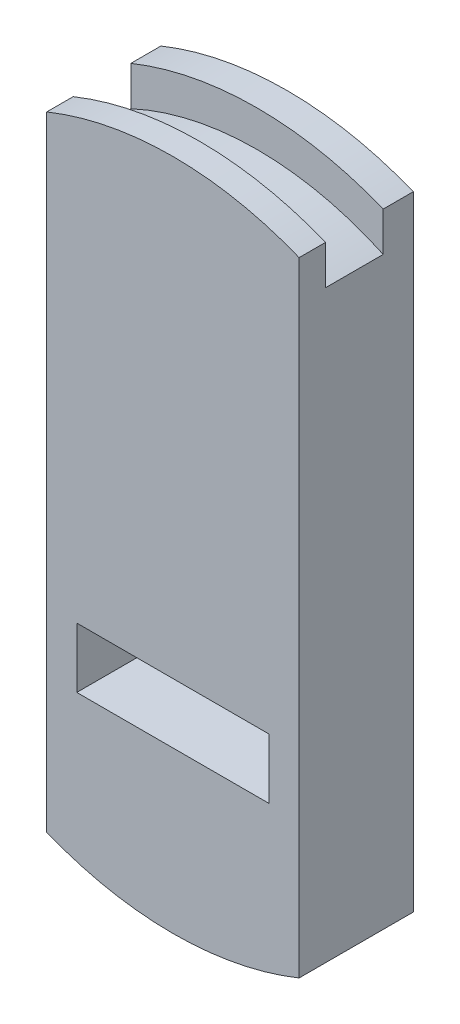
ISO-10303-21;
HEADER;
FILE_DESCRIPTION(('STEP AP214'),'2;1');
FILE_NAME('part.step','',(''),(''),'','','');
FILE_SCHEMA(('AUTOMOTIVE_DESIGN { 1 0 10303 214 1 1 1 1 }'));
ENDSEC;
DATA;
#1=APPLICATION_CONTEXT('core data for automotive mechanical design processes');
#2=APPLICATION_PROTOCOL_DEFINITION('international standard','automotive_design',2000,#1);
#3=PRODUCT_CONTEXT('',#1,'mechanical');
#4=PRODUCT('Part','Part','',(#3));
#5=PRODUCT_RELATED_PRODUCT_CATEGORY('part','',(#4));
#6=PRODUCT_DEFINITION_FORMATION('','',#4);
#7=PRODUCT_DEFINITION_CONTEXT('part definition',#1,'design');
#8=PRODUCT_DEFINITION('design','',#6,#7);
#9=PRODUCT_DEFINITION_SHAPE('','',#8);
#10=(LENGTH_UNIT() NAMED_UNIT(*) SI_UNIT(.MILLI.,.METRE.));
#11=(NAMED_UNIT(*) PLANE_ANGLE_UNIT() SI_UNIT($,.RADIAN.));
#12=(NAMED_UNIT(*) SI_UNIT($,.STERADIAN.) SOLID_ANGLE_UNIT());
#13=UNCERTAINTY_MEASURE_WITH_UNIT(LENGTH_MEASURE(1.E-05),#10,'distance_accuracy_value','');
#14=(GEOMETRIC_REPRESENTATION_CONTEXT(3) GLOBAL_UNCERTAINTY_ASSIGNED_CONTEXT((#13)) GLOBAL_UNIT_ASSIGNED_CONTEXT((#10,
#11,#12)) REPRESENTATION_CONTEXT('',''));
#15=CARTESIAN_POINT('',(0.,0.,0.));
#16=DIRECTION('',(0.,0.,1.));
#17=DIRECTION('',(1.,0.,0.));
#18=AXIS2_PLACEMENT_3D('',#15,#16,#17);
#19=CARTESIAN_POINT('',(0.,0.,7.3));
#20=DIRECTION('',(0.,0.,1.));
#21=DIRECTION('',(1.,0.,0.));
#22=AXIS2_PLACEMENT_3D('',#19,#20,#21);
#23=PLANE('',#22);
#24=CARTESIAN_POINT('',(0.,0.,7.3));
#25=DIRECTION('',(0.,0.,1.));
#26=DIRECTION('',(1.,0.,0.));
#27=AXIS2_PLACEMENT_3D('',#24,#25,#26);
#28=CIRCLE('',#27,28.);
#29=CARTESIAN_POINT('',(10.5,25.9566947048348,7.3));
#30=VERTEX_POINT('',#29);
#31=CARTESIAN_POINT('',(-10.5,25.9566947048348,7.3));
#32=VERTEX_POINT('',#31);
#33=EDGE_CURVE('E176',#30,#32,#28,.T.);
#34=ORIENTED_EDGE('',*,*,#33,.F.);
#35=DIRECTION('',(0.,-1.,0.));
#36=VECTOR('',#35,1.);
#37=CARTESIAN_POINT('',(10.5,0.,7.3));
#38=LINE('',#37,#36);
#39=CARTESIAN_POINT('',(10.5,22.6881026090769,7.3));
#40=VERTEX_POINT('',#39);
#41=EDGE_CURVE('E138',#30,#40,#38,.T.);
#42=ORIENTED_EDGE('',*,*,#41,.T.);
#43=CARTESIAN_POINT('',(0.,0.,7.3));
#44=DIRECTION('',(0.,0.,1.));
#45=DIRECTION('',(1.,0.,0.));
#46=AXIS2_PLACEMENT_3D('',#43,#44,#45);
#47=CIRCLE('',#46,25.);
#48=CARTESIAN_POINT('',(-10.5,22.6881026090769,7.3));
#49=VERTEX_POINT('',#48);
#50=EDGE_CURVE('E171',#40,#49,#47,.T.);
#51=ORIENTED_EDGE('',*,*,#50,.T.);
#52=DIRECTION('',(0.,1.,0.));
#53=VECTOR('',#52,1.);
#54=CARTESIAN_POINT('',(-10.5,0.,7.3));
#55=LINE('',#54,#53);
#56=EDGE_CURVE('E154',#49,#32,#55,.T.);
#57=ORIENTED_EDGE('',*,*,#56,.T.);
#58=EDGE_LOOP('',(#34,#42,#51,#57));
#59=FACE_BOUND('',#58,.T.);
#60=ADVANCED_FACE('F34',(#59),#23,.F.);
#61=CARTESIAN_POINT('',(0.,0.,2.5));
#62=DIRECTION('',(0.,0.,-1.));
#63=DIRECTION('',(-1.,0.,0.));
#64=AXIS2_PLACEMENT_3D('',#61,#62,#63);
#65=CYLINDRICAL_SURFACE('',#64,28.);
#66=DIRECTION('',(0.,0.,-1.));
#67=VECTOR('',#66,1.);
#68=CARTESIAN_POINT('',(10.5,25.9566947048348,2.5));
#69=LINE('',#68,#67);
#70=CARTESIAN_POINT('',(10.5,25.9566947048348,0.));
#71=VERTEX_POINT('',#70);
#72=CARTESIAN_POINT('',(10.5,25.9566947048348,2.5));
#73=VERTEX_POINT('',#72);
#74=EDGE_CURVE('E144',#71,#73,#69,.F.);
#75=ORIENTED_EDGE('',*,*,#74,.F.);
#76=CARTESIAN_POINT('',(0.,0.,0.));
#77=DIRECTION('',(0.,0.,-1.));
#78=DIRECTION('',(-1.,0.,0.));
#79=AXIS2_PLACEMENT_3D('',#76,#77,#78);
#80=CIRCLE('',#79,28.);
#81=CARTESIAN_POINT('',(-10.5,25.9566947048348,0.));
#82=VERTEX_POINT('',#81);
#83=EDGE_CURVE('E172',#82,#71,#80,.T.);
#84=ORIENTED_EDGE('',*,*,#83,.F.);
#85=DIRECTION('',(0.,0.,-1.));
#86=VECTOR('',#85,1.);
#87=CARTESIAN_POINT('',(-10.5,25.9566947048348,2.5));
#88=LINE('',#87,#86);
#89=CARTESIAN_POINT('',(-10.5,25.9566947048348,2.5));
#90=VERTEX_POINT('',#89);
#91=EDGE_CURVE('E152',#90,#82,#88,.T.);
#92=ORIENTED_EDGE('',*,*,#91,.F.);
#93=CARTESIAN_POINT('',(0.,0.,2.5));
#94=DIRECTION('',(0.,0.,-1.));
#95=DIRECTION('',(-1.,0.,0.));
#96=AXIS2_PLACEMENT_3D('',#93,#94,#95);
#97=CIRCLE('',#96,28.);
#98=EDGE_CURVE('E168',#90,#73,#97,.T.);
#99=ORIENTED_EDGE('',*,*,#98,.T.);
#100=EDGE_LOOP('',(#75,#84,#92,#99));
#101=FACE_BOUND('',#100,.T.);
#102=ADVANCED_FACE('F213',(#101),#65,.T.);
#103=CARTESIAN_POINT('',(0.,0.,9.8));
#104=DIRECTION('',(0.,0.,-1.));
#105=DIRECTION('',(-1.,0.,0.));
#106=AXIS2_PLACEMENT_3D('',#103,#104,#105);
#107=CYLINDRICAL_SURFACE('',#106,25.);
#108=ORIENTED_EDGE('',*,*,#50,.F.);
#109=DIRECTION('',(0.,0.,-1.));
#110=VECTOR('',#109,1.);
#111=CARTESIAN_POINT('',(10.5,22.6881026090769,9.8));
#112=LINE('',#111,#110);
#113=CARTESIAN_POINT('',(10.5,22.6881026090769,2.5));
#114=VERTEX_POINT('',#113);
#115=EDGE_CURVE('E237',#40,#114,#112,.T.);
#116=ORIENTED_EDGE('',*,*,#115,.T.);
#117=CARTESIAN_POINT('',(0.,0.,2.5));
#118=DIRECTION('',(0.,0.,-1.));
#119=DIRECTION('',(-1.,0.,0.));
#120=AXIS2_PLACEMENT_3D('',#117,#118,#119);
#121=CIRCLE('',#120,25.);
#122=CARTESIAN_POINT('',(-10.5,22.6881026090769,2.5));
#123=VERTEX_POINT('',#122);
#124=EDGE_CURVE('E164',#123,#114,#121,.T.);
#125=ORIENTED_EDGE('',*,*,#124,.F.);
#126=DIRECTION('',(0.,0.,-1.));
#127=VECTOR('',#126,1.);
#128=CARTESIAN_POINT('',(-10.5,22.6881026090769,9.8));
#129=LINE('',#128,#127);
#130=EDGE_CURVE('E149',#123,#49,#129,.F.);
#131=ORIENTED_EDGE('',*,*,#130,.T.);
#132=EDGE_LOOP('',(#108,#116,#125,#131));
#133=FACE_BOUND('',#132,.T.);
#134=ADVANCED_FACE('F36',(#133),#107,.T.);
#135=CARTESIAN_POINT('',(0.,0.,0.));
#136=DIRECTION('',(0.,0.,1.));
#137=DIRECTION('',(1.,0.,0.));
#138=AXIS2_PLACEMENT_3D('',#135,#136,#137);
#139=PLANE('',#138);
#140=DIRECTION('',(-1.,0.,0.));
#141=VECTOR('',#140,1.);
#142=CARTESIAN_POINT('',(0.,-9.62742915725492,0.));
#143=LINE('',#142,#141);
#144=CARTESIAN_POINT('',(8.,-9.62742915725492,0.));
#145=VERTEX_POINT('',#144);
#146=CARTESIAN_POINT('',(-8.,-9.62742915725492,0.));
#147=VERTEX_POINT('',#146);
#148=EDGE_CURVE('E196',#145,#147,#143,.T.);
#149=ORIENTED_EDGE('',*,*,#148,.T.);
#150=DIRECTION('',(0.,-1.,0.));
#151=VECTOR('',#150,1.);
#152=CARTESIAN_POINT('',(-8.,0.,0.));
#153=LINE('',#152,#151);
#154=CARTESIAN_POINT('',(-8.,-14.6274291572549,0.));
#155=VERTEX_POINT('',#154);
#156=EDGE_CURVE('E199',#147,#155,#153,.T.);
#157=ORIENTED_EDGE('',*,*,#156,.T.);
#158=DIRECTION('',(1.,0.,0.));
#159=VECTOR('',#158,1.);
#160=CARTESIAN_POINT('',(0.,-14.6274291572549,0.));
#161=LINE('',#160,#159);
#162=CARTESIAN_POINT('',(8.,-14.6274291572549,0.));
#163=VERTEX_POINT('',#162);
#164=EDGE_CURVE('E182',#155,#163,#161,.T.);
#165=ORIENTED_EDGE('',*,*,#164,.T.);
#166=DIRECTION('',(0.,1.,0.));
#167=VECTOR('',#166,1.);
#168=CARTESIAN_POINT('',(8.,0.,0.));
#169=LINE('',#168,#167);
#170=EDGE_CURVE('E193',#163,#145,#169,.T.);
#171=ORIENTED_EDGE('',*,*,#170,.T.);
#172=EDGE_LOOP('',(#149,#157,#165,#171));
#173=FACE_BOUND('',#172,.T.);
#174=ORIENTED_EDGE('',*,*,#83,.T.);
#175=DIRECTION('',(0.,-1.,0.));
#176=VECTOR('',#175,1.);
#177=CARTESIAN_POINT('',(10.5,0.,0.));
#178=LINE('',#177,#176);
#179=CARTESIAN_POINT('',(10.5,-25.9566947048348,0.));
#180=VERTEX_POINT('',#179);
#181=EDGE_CURVE('E139',#71,#180,#178,.T.);
#182=ORIENTED_EDGE('',*,*,#181,.T.);
#183=CARTESIAN_POINT('',(-10.5,-25.9566947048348,0.));
#184=VERTEX_POINT('',#183);
#185=EDGE_CURVE('E167',#180,#184,#80,.T.);
#186=ORIENTED_EDGE('',*,*,#185,.T.);
#187=DIRECTION('',(0.,1.,0.));
#188=VECTOR('',#187,1.);
#189=CARTESIAN_POINT('',(-10.5,0.,0.));
#190=LINE('',#189,#188);
#191=EDGE_CURVE('E158',#184,#82,#190,.T.);
#192=ORIENTED_EDGE('',*,*,#191,.T.);
#193=EDGE_LOOP('',(#174,#182,#186,#192));
#194=FACE_BOUND('',#193,.T.);
#195=ADVANCED_FACE('F220',(#173,#194),#139,.F.);
#196=CARTESIAN_POINT('',(-8.,-9.62742915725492,-0.199999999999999));
#197=DIRECTION('',(-1.,0.,0.));
#198=DIRECTION('',(0.,0.,1.));
#199=AXIS2_PLACEMENT_3D('',#196,#197,#198);
#200=PLANE('',#199);
#201=DIRECTION('',(0.,0.,1.));
#202=VECTOR('',#201,1.);
#203=CARTESIAN_POINT('',(-8.,-9.62742915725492,-0.199999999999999));
#204=LINE('',#203,#202);
#205=CARTESIAN_POINT('',(-8.,-9.62742915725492,9.5));
#206=VERTEX_POINT('',#205);
#207=EDGE_CURVE('E179',#147,#206,#204,.T.);
#208=ORIENTED_EDGE('',*,*,#207,.T.);
#209=DIRECTION('',(0.,-1.,0.));
#210=VECTOR('',#209,1.);
#211=CARTESIAN_POINT('',(-8.,-9.62742915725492,9.5));
#212=LINE('',#211,#210);
#213=CARTESIAN_POINT('',(-8.,-14.6274291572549,9.5));
#214=VERTEX_POINT('',#213);
#215=EDGE_CURVE('E234',#206,#214,#212,.T.);
#216=ORIENTED_EDGE('',*,*,#215,.T.);
#217=DIRECTION('',(0.,0.,1.));
#218=VECTOR('',#217,1.);
#219=CARTESIAN_POINT('',(-8.,-14.6274291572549,-0.199999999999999));
#220=LINE('',#219,#218);
#221=EDGE_CURVE('E178',#155,#214,#220,.T.);
#222=ORIENTED_EDGE('',*,*,#221,.F.);
#223=ORIENTED_EDGE('',*,*,#156,.F.);
#224=EDGE_LOOP('',(#208,#216,#222,#223));
#225=FACE_BOUND('',#224,.T.);
#226=ADVANCED_FACE('F256',(#225),#200,.F.);
#227=CARTESIAN_POINT('',(-8.,-9.62742915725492,-0.199999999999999));
#228=DIRECTION('',(0.,1.,0.));
#229=DIRECTION('',(0.,0.,1.));
#230=AXIS2_PLACEMENT_3D('',#227,#228,#229);
#231=PLANE('',#230);
#232=DIRECTION('',(0.,0.,1.));
#233=VECTOR('',#232,1.);
#234=CARTESIAN_POINT('',(8.,-9.62742915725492,-0.199999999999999));
#235=LINE('',#234,#233);
#236=CARTESIAN_POINT('',(8.,-9.62742915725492,9.5));
#237=VERTEX_POINT('',#236);
#238=EDGE_CURVE('E183',#145,#237,#235,.T.);
#239=ORIENTED_EDGE('',*,*,#238,.T.);
#240=DIRECTION('',(-1.,0.,0.));
#241=VECTOR('',#240,1.);
#242=CARTESIAN_POINT('',(-8.,-9.62742915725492,9.5));
#243=LINE('',#242,#241);
#244=EDGE_CURVE('E231',#237,#206,#243,.T.);
#245=ORIENTED_EDGE('',*,*,#244,.T.);
#246=ORIENTED_EDGE('',*,*,#207,.F.);
#247=ORIENTED_EDGE('',*,*,#148,.F.);
#248=EDGE_LOOP('',(#239,#245,#246,#247));
#249=FACE_BOUND('',#248,.T.);
#250=ADVANCED_FACE('F252',(#249),#231,.F.);
#251=CARTESIAN_POINT('',(8.,-9.62742915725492,-0.199999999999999));
#252=DIRECTION('',(1.,0.,0.));
#253=DIRECTION('',(0.,0.,-1.));
#254=AXIS2_PLACEMENT_3D('',#251,#252,#253);
#255=PLANE('',#254);
#256=DIRECTION('',(0.,0.,1.));
#257=VECTOR('',#256,1.);
#258=CARTESIAN_POINT('',(8.,-14.6274291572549,-0.199999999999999));
#259=LINE('',#258,#257);
#260=CARTESIAN_POINT('',(8.,-14.6274291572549,9.5));
#261=VERTEX_POINT('',#260);
#262=EDGE_CURVE('E186',#163,#261,#259,.T.);
#263=ORIENTED_EDGE('',*,*,#262,.T.);
#264=DIRECTION('',(0.,1.,0.));
#265=VECTOR('',#264,1.);
#266=CARTESIAN_POINT('',(8.,-9.62742915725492,9.5));
#267=LINE('',#266,#265);
#268=EDGE_CURVE('E49',#261,#237,#267,.T.);
#269=ORIENTED_EDGE('',*,*,#268,.T.);
#270=ORIENTED_EDGE('',*,*,#238,.F.);
#271=ORIENTED_EDGE('',*,*,#170,.F.);
#272=EDGE_LOOP('',(#263,#269,#270,#271));
#273=FACE_BOUND('',#272,.T.);
#274=ADVANCED_FACE('F255',(#273),#255,.F.);
#275=CARTESIAN_POINT('',(-8.,-14.6274291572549,-0.199999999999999));
#276=DIRECTION('',(0.,-1.,0.));
#277=DIRECTION('',(0.,0.,-1.));
#278=AXIS2_PLACEMENT_3D('',#275,#276,#277);
#279=PLANE('',#278);
#280=ORIENTED_EDGE('',*,*,#221,.T.);
#281=DIRECTION('',(1.,0.,0.));
#282=VECTOR('',#281,1.);
#283=CARTESIAN_POINT('',(-8.,-14.6274291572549,9.5));
#284=LINE('',#283,#282);
#285=EDGE_CURVE('E134',#214,#261,#284,.T.);
#286=ORIENTED_EDGE('',*,*,#285,.T.);
#287=ORIENTED_EDGE('',*,*,#262,.F.);
#288=ORIENTED_EDGE('',*,*,#164,.F.);
#289=EDGE_LOOP('',(#280,#286,#287,#288));
#290=FACE_BOUND('',#289,.T.);
#291=ADVANCED_FACE('F251',(#290),#279,.F.);
#292=CARTESIAN_POINT('',(0.,0.,7.3));
#293=DIRECTION('',(0.,0.,1.));
#294=DIRECTION('',(1.,0.,0.));
#295=AXIS2_PLACEMENT_3D('',#292,#293,#294);
#296=CYLINDRICAL_SURFACE('',#295,28.);
#297=CARTESIAN_POINT('',(0.,0.,9.5));
#298=DIRECTION('',(0.,0.,-1.));
#299=DIRECTION('',(-1.,0.,0.));
#300=AXIS2_PLACEMENT_3D('',#297,#298,#299);
#301=CIRCLE('',#300,28.);
#302=CARTESIAN_POINT('',(10.5,25.9566947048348,9.5));
#303=VERTEX_POINT('',#302);
#304=CARTESIAN_POINT('',(-10.5,25.9566947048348,9.5));
#305=VERTEX_POINT('',#304);
#306=EDGE_CURVE('E121',#303,#305,#301,.F.);
#307=ORIENTED_EDGE('',*,*,#306,.F.);
#308=DIRECTION('',(0.,0.,1.));
#309=VECTOR('',#308,1.);
#310=CARTESIAN_POINT('',(10.5,25.9566947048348,7.3));
#311=LINE('',#310,#309);
#312=EDGE_CURVE('E131',#30,#303,#311,.T.);
#313=ORIENTED_EDGE('',*,*,#312,.F.);
#314=ORIENTED_EDGE('',*,*,#33,.T.);
#315=DIRECTION('',(0.,0.,1.));
#316=VECTOR('',#315,1.);
#317=CARTESIAN_POINT('',(-10.5,25.9566947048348,7.3));
#318=LINE('',#317,#316);
#319=EDGE_CURVE('E133',#305,#32,#318,.F.);
#320=ORIENTED_EDGE('',*,*,#319,.F.);
#321=EDGE_LOOP('',(#307,#313,#314,#320));
#322=FACE_BOUND('',#321,.T.);
#323=ADVANCED_FACE('F129',(#322),#296,.T.);
#324=CARTESIAN_POINT('',(0.,0.,9.5));
#325=DIRECTION('',(0.,0.,-1.));
#326=DIRECTION('',(-1.,0.,0.));
#327=AXIS2_PLACEMENT_3D('',#324,#325,#326);
#328=CIRCLE('',#327,28.);
#329=CARTESIAN_POINT('',(-10.5,-25.9566947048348,9.5));
#330=VERTEX_POINT('',#329);
#331=CARTESIAN_POINT('',(10.5,-25.9566947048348,9.5));
#332=VERTEX_POINT('',#331);
#333=EDGE_CURVE('E57',#330,#332,#328,.F.);
#334=ORIENTED_EDGE('',*,*,#333,.F.);
#335=DIRECTION('',(0.,0.,-1.));
#336=VECTOR('',#335,1.);
#337=CARTESIAN_POINT('',(-10.5,-25.9566947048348,2.5));
#338=LINE('',#337,#336);
#339=EDGE_CURVE('E161',#184,#330,#338,.F.);
#340=ORIENTED_EDGE('',*,*,#339,.F.);
#341=ORIENTED_EDGE('',*,*,#185,.F.);
#342=DIRECTION('',(0.,0.,-1.));
#343=VECTOR('',#342,1.);
#344=CARTESIAN_POINT('',(10.5,-25.9566947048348,2.5));
#345=LINE('',#344,#343);
#346=EDGE_CURVE('E142',#332,#180,#345,.T.);
#347=ORIENTED_EDGE('',*,*,#346,.F.);
#348=EDGE_LOOP('',(#334,#340,#341,#347));
#349=FACE_BOUND('',#348,.T.);
#350=ADVANCED_FACE('F223',(#349),#65,.T.);
#351=CARTESIAN_POINT('',(0.,0.,2.5));
#352=DIRECTION('',(0.,0.,-1.));
#353=DIRECTION('',(-1.,0.,0.));
#354=AXIS2_PLACEMENT_3D('',#351,#352,#353);
#355=PLANE('',#354);
#356=ORIENTED_EDGE('',*,*,#124,.T.);
#357=DIRECTION('',(0.,1.,0.));
#358=VECTOR('',#357,1.);
#359=CARTESIAN_POINT('',(10.5,0.,2.5));
#360=LINE('',#359,#358);
#361=EDGE_CURVE('E42',#114,#73,#360,.T.);
#362=ORIENTED_EDGE('',*,*,#361,.T.);
#363=ORIENTED_EDGE('',*,*,#98,.F.);
#364=DIRECTION('',(0.,-1.,0.));
#365=VECTOR('',#364,1.);
#366=CARTESIAN_POINT('',(-10.5,0.,2.5));
#367=LINE('',#366,#365);
#368=EDGE_CURVE('E202',#90,#123,#367,.T.);
#369=ORIENTED_EDGE('',*,*,#368,.T.);
#370=EDGE_LOOP('',(#356,#362,#363,#369));
#371=FACE_BOUND('',#370,.T.);
#372=ADVANCED_FACE('F207',(#371),#355,.F.);
#373=CARTESIAN_POINT('',(-10.5,33.082276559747,-5.2));
#374=DIRECTION('',(1.,0.,0.));
#375=DIRECTION('',(0.,1.,0.));
#376=AXIS2_PLACEMENT_3D('',#373,#374,#375);
#377=PLANE('',#376);
#378=ORIENTED_EDGE('',*,*,#339,.T.);
#379=DIRECTION('',(0.,1.,0.));
#380=VECTOR('',#379,1.);
#381=CARTESIAN_POINT('',(-10.5,33.082276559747,9.5));
#382=LINE('',#381,#380);
#383=EDGE_CURVE('E224',#330,#305,#382,.T.);
#384=ORIENTED_EDGE('',*,*,#383,.T.);
#385=ORIENTED_EDGE('',*,*,#319,.T.);
#386=ORIENTED_EDGE('',*,*,#56,.F.);
#387=ORIENTED_EDGE('',*,*,#130,.F.);
#388=ORIENTED_EDGE('',*,*,#368,.F.);
#389=ORIENTED_EDGE('',*,*,#91,.T.);
#390=ORIENTED_EDGE('',*,*,#191,.F.);
#391=EDGE_LOOP('',(#378,#384,#385,#386,#387,#388,#389,#390));
#392=FACE_BOUND('',#391,.T.);
#393=ADVANCED_FACE('F217',(#392),#377,.F.);
#394=CARTESIAN_POINT('',(10.5,33.082276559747,-5.2));
#395=DIRECTION('',(-1.,0.,0.));
#396=DIRECTION('',(0.,-1.,0.));
#397=AXIS2_PLACEMENT_3D('',#394,#395,#396);
#398=PLANE('',#397);
#399=ORIENTED_EDGE('',*,*,#312,.T.);
#400=DIRECTION('',(0.,-1.,0.));
#401=VECTOR('',#400,1.);
#402=CARTESIAN_POINT('',(10.5,33.082276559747,9.5));
#403=LINE('',#402,#401);
#404=EDGE_CURVE('E11',#303,#332,#403,.T.);
#405=ORIENTED_EDGE('',*,*,#404,.T.);
#406=ORIENTED_EDGE('',*,*,#346,.T.);
#407=ORIENTED_EDGE('',*,*,#181,.F.);
#408=ORIENTED_EDGE('',*,*,#74,.T.);
#409=ORIENTED_EDGE('',*,*,#361,.F.);
#410=ORIENTED_EDGE('',*,*,#115,.F.);
#411=ORIENTED_EDGE('',*,*,#41,.F.);
#412=EDGE_LOOP('',(#399,#405,#406,#407,#408,#409,#410,#411));
#413=FACE_BOUND('',#412,.T.);
#414=ADVANCED_FACE('F136',(#413),#398,.F.);
#415=CARTESIAN_POINT('',(-49.5,31.8894781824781,9.5));
#416=DIRECTION('',(0.,0.,-1.));
#417=DIRECTION('',(-1.,0.,0.));
#418=AXIS2_PLACEMENT_3D('',#415,#416,#417);
#419=PLANE('',#418);
#420=ORIENTED_EDGE('',*,*,#306,.T.);
#421=ORIENTED_EDGE('',*,*,#383,.F.);
#422=ORIENTED_EDGE('',*,*,#333,.T.);
#423=ORIENTED_EDGE('',*,*,#404,.F.);
#424=EDGE_LOOP('',(#420,#421,#422,#423));
#425=FACE_BOUND('',#424,.T.);
#426=ORIENTED_EDGE('',*,*,#244,.F.);
#427=ORIENTED_EDGE('',*,*,#268,.F.);
#428=ORIENTED_EDGE('',*,*,#285,.F.);
#429=ORIENTED_EDGE('',*,*,#215,.F.);
#430=EDGE_LOOP('',(#426,#427,#428,#429));
#431=FACE_BOUND('',#430,.T.);
#432=ADVANCED_FACE('F120',(#425,#431),#419,.F.);
#433=CLOSED_SHELL('',(#60,#102,#134,#195,#226,#250,#274,#291,#323,#350,#372,#393,#414,#432));
#434=MANIFOLD_SOLID_BREP('B2',#433);
#435=ADVANCED_BREP_SHAPE_REPRESENTATION('',(#18,#434),#14);
#436=SHAPE_DEFINITION_REPRESENTATION(#9,#435);
ENDSEC;
END-ISO-10303-21;
